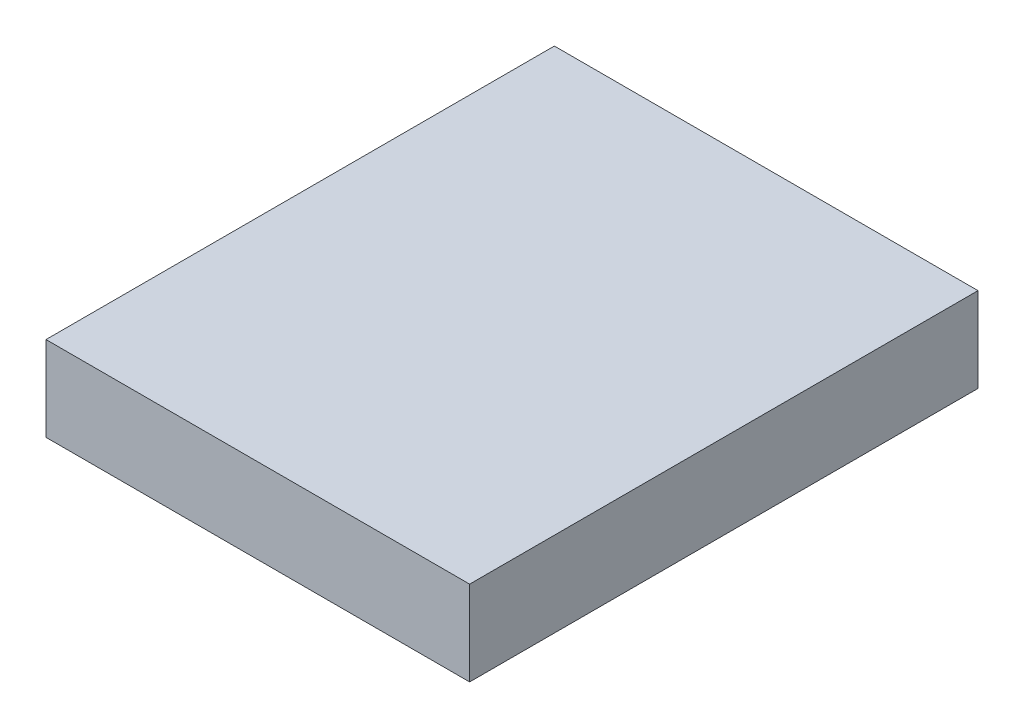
from build123d import *

# Parameters (mm, degrees)
SKETCH1_W      = 254
SKETCH1_H      = 304.8
EXTRUDE1_DEPTH = 50.8


with BuildPart() as part:
    # Sketch1 → Extrude1 (new body)
    with BuildSketch(Plane(origin=(0, 0, 0), x_dir=(1, 0, 0), z_dir=(0, 1, 0))):
        Rectangle(SKETCH1_W, SKETCH1_H)
    extrude(amount=EXTRUDE1_DEPTH)


solid = part.part
